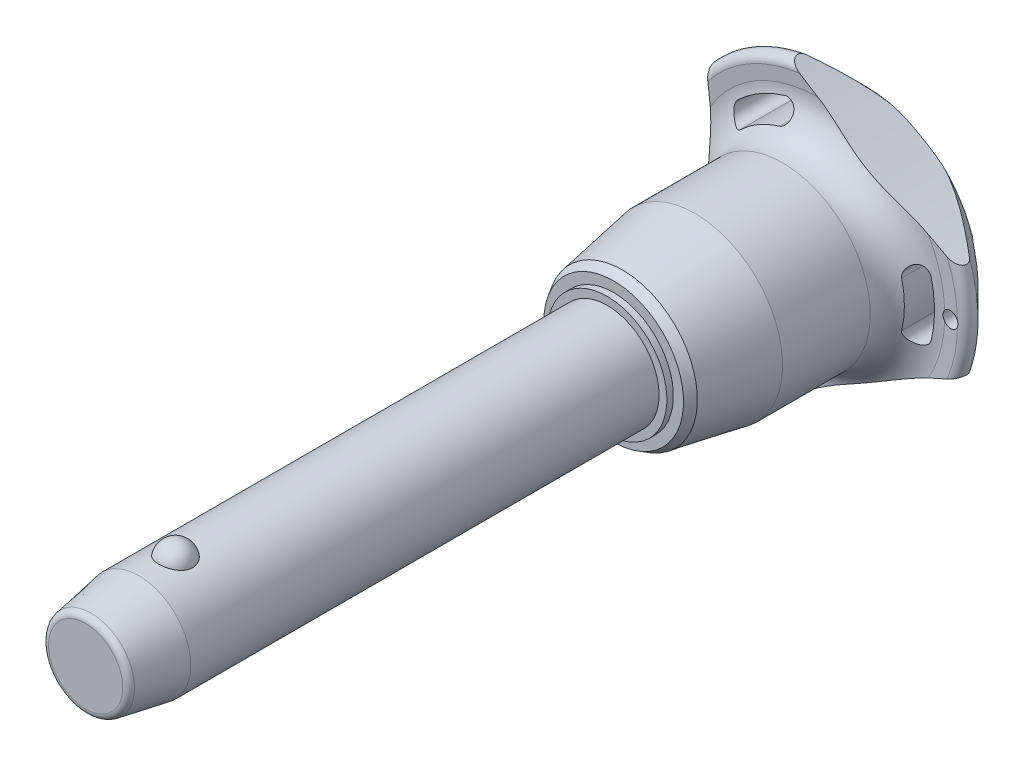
from build123d import *

# Parameters (mm, degrees)
SKETCH1_R           = 10
BOSS_EXTRUDE1_DEPTH = 80
SKETCH2_R           = 8.75
BOSS_EXTRUDE2_DEPTH = 50.7
BOSS_EXTRUDE3_START = 20.5
SKETCH1_2_R         = 10
BOSS_EXTRUDE3_DEPTH = 20.5
CHAMFER1_SIZE       = 10.25
CHAMFER1_SIZE2      = 1.807351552
FILLET1_R           = 1.25
SKETCH6_R           = 176.92625
CUT_EXTRUDE1_DEPTH  = 137.79481676
CIRPATTERN1_COUNT   = 3
SKETCH7_R           = 1.5
CUT_EXTRUDE2_DEPTH  = 137.683489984


with BuildPart() as part:
    # Sketch1 → Boss-Extrude1 (new body)
    with BuildSketch(Plane.XY):
        Circle(SKETCH1_R)
    extrude(amount=-BOSS_EXTRUDE1_DEPTH)

    # Sketch2 → Boss-Extrude2 (add)
    with BuildSketch(Plane(origin=(0, 0, -80), x_dir=(-1, 0, 0), z_dir=(0, 0, -1))):
        with Locations(Location((0, 0, 0), (0, 0, 180))):
            Circle(SKETCH2_R)
    extrude(amount=BOSS_EXTRUDE2_DEPTH)

    # Sketch3 → Revolve1 (revolve)
    with BuildSketch(Plane(origin=(0, 0, 0), x_dir=(0, 0, -1), z_dir=(1, 0, 0))):
        with BuildLine():
            Line((-3.201562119, 12.5), (-3.201562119, 5.9))
            ThreePointArc((-3.201562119, 5.9), (0.098437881, 9.2), (-3.201562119, 12.5))
        make_face()
        with BuildLine():
            Line((-3.201562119, -5.9), (-3.201562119, -12.5))
            ThreePointArc((-3.201562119, -12.5), (0.098437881, -9.2), (-3.201562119, -5.9))
        make_face()
    revolve(axis=Axis((0, -5.9, 3.201562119), (0, 1, 0)))

    # Sketch1_2 → Boss-Extrude3 (add)
    with BuildSketch(Plane.XY.offset(BOSS_EXTRUDE3_START)):
        Circle(SKETCH1_2_R)
    extrude(amount=-BOSS_EXTRUDE3_DEPTH)

    # Chamfer1
    chamfer1_edges = [part.edges().sort_by_distance(p)[0] for p in [
        (-10, 0, 20.5),
    ]]
    chamfer1_side = [part.faces().sort_by_distance(p)[0] for p in [
        (-10, 0, -29.75),
    ]]
    chamfer(chamfer1_edges, length=CHAMFER1_SIZE, length2=CHAMFER1_SIZE2, reference=chamfer1_side[0])

    # Fillet1
    fillet1_edges = [part.edges().sort_by_distance(p)[0] for p in [
        (-8.192648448, 0, 20.5),
        (-8.75, 0, -130.7),
    ]]
    fillet(fillet1_edges, radius=FILLET1_R)

    # Sketch4 → Revolve2 (revolve)
    with BuildSketch(Plane(origin=(0, 0, 0), x_dir=(0, 0, -1), z_dir=(1, 0, 0)), mode=Mode.PRIVATE) as revolve2_sk:
        Polygon((80, 0), (80, 11.504815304), (81.25, 11.504815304), (81.25, 13.461079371), (82.944174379, 14.439211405), (96.9, 16.9), (113.8, 16.9), (113.8, 0), align=None)
    revolve(revolve2_sk.sketch.rotate(Axis((0, 0, -113.8), (0, 0, 1)), 90), axis=Axis((0, 0, -113.8), (0, 0, 1)))

    # Sketch5 → Revolve3 (revolve)
    with BuildSketch(Plane(origin=(0, 0, 0), x_dir=(0, 0, -1), z_dir=(1, 0, 0)), mode=Mode.PRIVATE) as revolve3_sk:
        with BuildLine():
            Line((120.790129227, 24.271609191), (120.652256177, 26.865060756))
            ThreePointArc((120.652256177, 26.865060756), (121.598671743, 28.411427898), (123.38137085, 28.08137085))
            Line((123.38137085, 28.08137085), (129.763226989, 21.69951471))
            ThreePointArc((129.763226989, 21.69951471), (130.7, 19.381044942), (129.683055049, 17.096604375))
            ThreePointArc((129.683055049, 17.096604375), (124.18864484, 9.321268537), (122.25, 0))
            Line((122.25, 0), (113.8, 0))
            Line((113.8, 0), (113.8, 16.9))
            ThreePointArc((113.8, 16.9), (118.879432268, 19.083427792), (120.790129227, 24.271609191))
        make_face()
    revolve(revolve3_sk.sketch.rotate(Axis((0, 0, -122.25), (0, 0, 1)), 90), axis=Axis((0, 0, -122.25), (0, 0, 1)))

    # Sketch6 → Cut-Extrude1 (cut, through all)
    with BuildSketch(Plane.XY):
        with Locations((-197.42625, 0)):
            Circle(SKETCH6_R)
        with BuildLine():
            ThreePointArc((21.802992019, -5.260839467), (22.428706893, 0), (21.802992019, 5.260839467))
            ThreePointArc((21.802992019, 5.260839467), (19.579234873, 6.620060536), (18.220013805, 4.39630339))
            ThreePointArc((18.220013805, 4.39630339), (18.742902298, 0), (18.220013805, -4.39630339))
            ThreePointArc((18.220013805, -4.39630339), (19.579234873, -6.620060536), (21.802992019, -5.260839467))
        make_face()
    cut_extrude1 = extrude(amount=-CUT_EXTRUDE1_DEPTH, mode=Mode.SUBTRACT)

    # CirPattern1: Cut-Extrude1 ×3 about axis
    cirpattern1_axis = Axis((0, 0, 0), (0, 0, 1))
    for i in range(1, CIRPATTERN1_COUNT):
        add(cut_extrude1.rotate(cirpattern1_axis, i * 360 / CIRPATTERN1_COUNT), mode=Mode.SUBTRACT)

    # Sketch7 → Cut-Extrude2 (cut, through all)
    with BuildSketch(Plane.XY):
        with Locations(Location((25.428706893, 0, 0), (0, 0, 17.230769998))):
            Circle(SKETCH7_R)
    extrude(amount=-CUT_EXTRUDE2_DEPTH, mode=Mode.SUBTRACT)


solid = part.part
